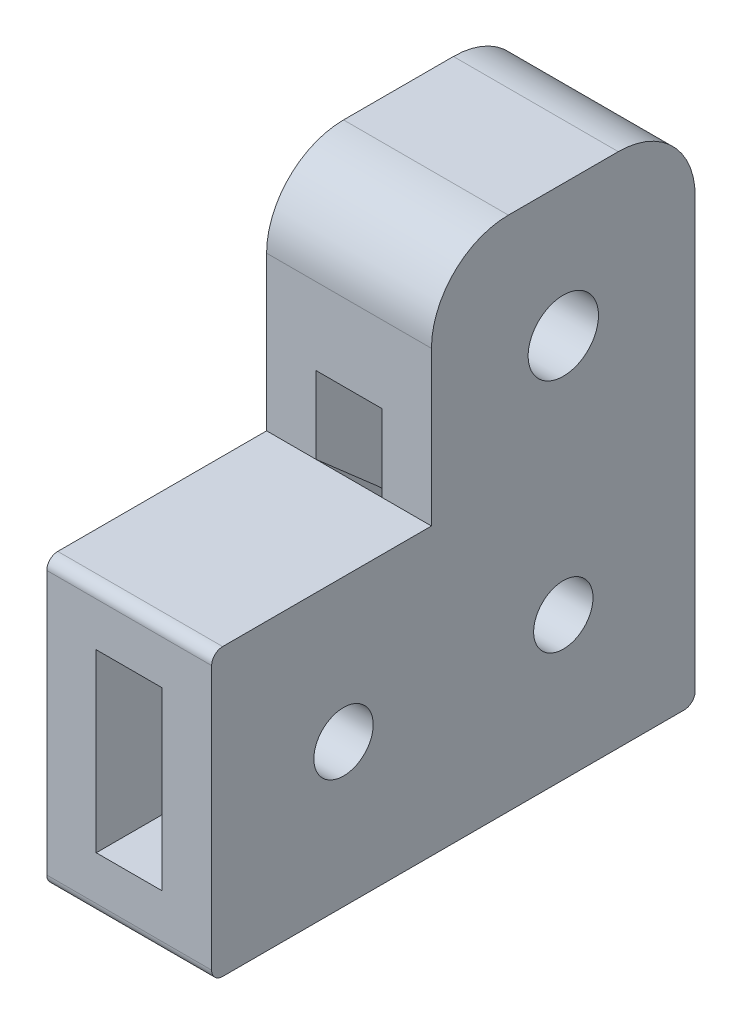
ISO-10303-21;
HEADER;
FILE_DESCRIPTION(('STEP AP214'),'2;1');
FILE_NAME('part.step','',(''),(''),'','','');
FILE_SCHEMA(('AUTOMOTIVE_DESIGN { 1 0 10303 214 1 1 1 1 }'));
ENDSEC;
DATA;
#1=APPLICATION_CONTEXT('core data for automotive mechanical design processes');
#2=APPLICATION_PROTOCOL_DEFINITION('international standard','automotive_design',2000,#1);
#3=PRODUCT_CONTEXT('',#1,'mechanical');
#4=PRODUCT('Part','Part','',(#3));
#5=PRODUCT_RELATED_PRODUCT_CATEGORY('part','',(#4));
#6=PRODUCT_DEFINITION_FORMATION('','',#4);
#7=PRODUCT_DEFINITION_CONTEXT('part definition',#1,'design');
#8=PRODUCT_DEFINITION('design','',#6,#7);
#9=PRODUCT_DEFINITION_SHAPE('','',#8);
#10=(LENGTH_UNIT() NAMED_UNIT(*) SI_UNIT(.MILLI.,.METRE.));
#11=(NAMED_UNIT(*) PLANE_ANGLE_UNIT() SI_UNIT($,.RADIAN.));
#12=(NAMED_UNIT(*) SI_UNIT($,.STERADIAN.) SOLID_ANGLE_UNIT());
#13=UNCERTAINTY_MEASURE_WITH_UNIT(LENGTH_MEASURE(1.E-05),#10,'distance_accuracy_value','');
#14=(GEOMETRIC_REPRESENTATION_CONTEXT(3) GLOBAL_UNCERTAINTY_ASSIGNED_CONTEXT((#13)) GLOBAL_UNIT_ASSIGNED_CONTEXT((#10,
#11,#12)) REPRESENTATION_CONTEXT('',''));
#15=CARTESIAN_POINT('',(0.,0.,0.));
#16=DIRECTION('',(0.,0.,1.));
#17=DIRECTION('',(1.,0.,0.));
#18=AXIS2_PLACEMENT_3D('',#15,#16,#17);
#19=CARTESIAN_POINT('',(7.5,-8.00000000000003,-12.));
#20=DIRECTION('',(-1.,0.,0.));
#21=DIRECTION('',(0.,0.,1.));
#22=AXIS2_PLACEMENT_3D('',#19,#20,#21);
#23=CYLINDRICAL_SURFACE('',#22,2.7);
#24=CARTESIAN_POINT('',(3.,-8.00000000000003,-12.));
#25=DIRECTION('',(-1.,0.,0.));
#26=DIRECTION('',(0.,-1.,0.));
#27=AXIS2_PLACEMENT_3D('',#24,#25,#26);
#28=CIRCLE('',#27,2.7);
#29=CARTESIAN_POINT('',(3.,-10.7,-12.));
#30=VERTEX_POINT('',#29);
#31=EDGE_CURVE('E320',#30,#30,#28,.T.);
#32=ORIENTED_EDGE('',*,*,#31,.T.);
#33=EDGE_LOOP('',(#32));
#34=FACE_BOUND('',#33,.T.);
#35=CARTESIAN_POINT('',(7.5,-8.00000000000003,-12.));
#36=DIRECTION('',(1.,0.,0.));
#37=DIRECTION('',(0.,0.,-1.));
#38=AXIS2_PLACEMENT_3D('',#35,#36,#37);
#39=CIRCLE('',#38,2.7);
#40=CARTESIAN_POINT('',(7.5,-8.00000000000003,-14.7));
#41=VERTEX_POINT('',#40);
#42=EDGE_CURVE('E377',#41,#41,#39,.T.);
#43=ORIENTED_EDGE('',*,*,#42,.T.);
#44=EDGE_LOOP('',(#43));
#45=FACE_BOUND('',#44,.T.);
#46=ADVANCED_FACE('F49',(#34,#45),#23,.F.);
#47=CARTESIAN_POINT('',(7.5,-8.00000000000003,8.));
#48=DIRECTION('',(-1.,0.,0.));
#49=DIRECTION('',(0.,0.,1.));
#50=AXIS2_PLACEMENT_3D('',#47,#48,#49);
#51=CYLINDRICAL_SURFACE('',#50,2.7);
#52=CARTESIAN_POINT('',(3.,-8.00000000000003,8.));
#53=DIRECTION('',(1.,0.,0.));
#54=DIRECTION('',(0.,1.,0.));
#55=AXIS2_PLACEMENT_3D('',#52,#53,#54);
#56=CIRCLE('',#55,2.7);
#57=CARTESIAN_POINT('',(3.,-5.30000000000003,8.));
#58=VERTEX_POINT('',#57);
#59=EDGE_CURVE('E224',#58,#58,#56,.T.);
#60=ORIENTED_EDGE('',*,*,#59,.F.);
#61=EDGE_LOOP('',(#60));
#62=FACE_BOUND('',#61,.T.);
#63=CARTESIAN_POINT('',(7.5,-8.00000000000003,8.));
#64=DIRECTION('',(1.,0.,0.));
#65=DIRECTION('',(0.,0.,-1.));
#66=AXIS2_PLACEMENT_3D('',#63,#64,#65);
#67=CIRCLE('',#66,2.7);
#68=CARTESIAN_POINT('',(7.5,-8.00000000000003,5.3));
#69=VERTEX_POINT('',#68);
#70=EDGE_CURVE('E369',#69,#69,#67,.T.);
#71=ORIENTED_EDGE('',*,*,#70,.T.);
#72=EDGE_LOOP('',(#71));
#73=FACE_BOUND('',#72,.T.);
#74=ADVANCED_FACE('F492',(#62,#73),#51,.F.);
#75=CARTESIAN_POINT('',(7.5,-21.,-24.));
#76=DIRECTION('',(0.,0.,1.));
#77=DIRECTION('',(1.,0.,0.));
#78=AXIS2_PLACEMENT_3D('',#75,#76,#77);
#79=PLANE('',#78);
#80=DIRECTION('',(0.,1.,0.));
#81=VECTOR('',#80,1.);
#82=CARTESIAN_POINT('',(7.5,-21.,-24.));
#83=LINE('',#82,#81);
#84=CARTESIAN_POINT('',(7.5,-20.,-24.));
#85=VERTEX_POINT('',#84);
#86=CARTESIAN_POINT('',(7.5,19.,-24.));
#87=VERTEX_POINT('',#86);
#88=EDGE_CURVE('E339',#85,#87,#83,.T.);
#89=ORIENTED_EDGE('',*,*,#88,.F.);
#90=DIRECTION('',(-1.,0.,0.));
#91=VECTOR('',#90,1.);
#92=CARTESIAN_POINT('',(7.5,-20.,-24.));
#93=LINE('',#92,#91);
#94=CARTESIAN_POINT('',(-7.5,-20.,-24.));
#95=VERTEX_POINT('',#94);
#96=EDGE_CURVE('E258',#85,#95,#93,.T.);
#97=ORIENTED_EDGE('',*,*,#96,.T.);
#98=DIRECTION('',(0.,1.,0.));
#99=VECTOR('',#98,1.);
#100=CARTESIAN_POINT('',(-7.5,-21.,-24.));
#101=LINE('',#100,#99);
#102=CARTESIAN_POINT('',(-7.5,19.,-24.));
#103=VERTEX_POINT('',#102);
#104=EDGE_CURVE('E359',#95,#103,#101,.T.);
#105=ORIENTED_EDGE('',*,*,#104,.T.);
#106=DIRECTION('',(-1.,0.,0.));
#107=VECTOR('',#106,1.);
#108=CARTESIAN_POINT('',(7.5,19.,-24.));
#109=LINE('',#108,#107);
#110=EDGE_CURVE('E294',#103,#87,#109,.F.);
#111=ORIENTED_EDGE('',*,*,#110,.T.);
#112=EDGE_LOOP('',(#89,#97,#105,#111));
#113=FACE_BOUND('',#112,.T.);
#114=DIRECTION('',(-1.,0.,0.));
#115=VECTOR('',#114,1.);
#116=CARTESIAN_POINT('',(-3.,-16.,-24.));
#117=LINE('',#116,#115);
#118=CARTESIAN_POINT('',(3.,-16.,-24.));
#119=VERTEX_POINT('',#118);
#120=CARTESIAN_POINT('',(-3.,-16.,-24.));
#121=VERTEX_POINT('',#120);
#122=EDGE_CURVE('E237',#119,#121,#117,.T.);
#123=ORIENTED_EDGE('',*,*,#122,.F.);
#124=DIRECTION('',(0.,-1.,0.));
#125=VECTOR('',#124,1.);
#126=CARTESIAN_POINT('',(3.,-16.,-24.));
#127=LINE('',#126,#125);
#128=CARTESIAN_POINT('',(3.,0.,-24.));
#129=VERTEX_POINT('',#128);
#130=EDGE_CURVE('E187',#129,#119,#127,.T.);
#131=ORIENTED_EDGE('',*,*,#130,.F.);
#132=DIRECTION('',(1.,0.,0.));
#133=VECTOR('',#132,1.);
#134=CARTESIAN_POINT('',(-3.,0.,-24.));
#135=LINE('',#134,#133);
#136=CARTESIAN_POINT('',(-3.,0.,-24.));
#137=VERTEX_POINT('',#136);
#138=EDGE_CURVE('E420',#137,#129,#135,.T.);
#139=ORIENTED_EDGE('',*,*,#138,.F.);
#140=DIRECTION('',(0.,1.,0.));
#141=VECTOR('',#140,1.);
#142=CARTESIAN_POINT('',(-3.,-16.,-24.));
#143=LINE('',#142,#141);
#144=EDGE_CURVE('E254',#121,#137,#143,.T.);
#145=ORIENTED_EDGE('',*,*,#144,.F.);
#146=EDGE_LOOP('',(#123,#131,#139,#145));
#147=FACE_BOUND('',#146,.T.);
#148=ADVANCED_FACE('F466',(#113,#147),#79,.F.);
#149=CARTESIAN_POINT('',(7.5,26.,0.));
#150=DIRECTION('',(0.,0.,-1.));
#151=DIRECTION('',(0.,1.,0.));
#152=AXIS2_PLACEMENT_3D('',#149,#150,#151);
#153=PLANE('',#152);
#154=DIRECTION('',(0.,-1.,0.));
#155=VECTOR('',#154,1.);
#156=CARTESIAN_POINT('',(7.5,26.,0.));
#157=LINE('',#156,#155);
#158=CARTESIAN_POINT('',(7.5,19.,0.));
#159=VERTEX_POINT('',#158);
#160=CARTESIAN_POINT('',(7.5,4.99999999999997,0.));
#161=VERTEX_POINT('',#160);
#162=EDGE_CURVE('E335',#159,#161,#157,.T.);
#163=ORIENTED_EDGE('',*,*,#162,.F.);
#164=DIRECTION('',(-1.,0.,0.));
#165=VECTOR('',#164,1.);
#166=CARTESIAN_POINT('',(7.5,19.,0.));
#167=LINE('',#166,#165);
#168=CARTESIAN_POINT('',(-7.5,19.,0.));
#169=VERTEX_POINT('',#168);
#170=EDGE_CURVE('E239',#159,#169,#167,.T.);
#171=ORIENTED_EDGE('',*,*,#170,.T.);
#172=DIRECTION('',(0.,-1.,0.));
#173=VECTOR('',#172,1.);
#174=CARTESIAN_POINT('',(-7.5,26.,0.));
#175=LINE('',#174,#173);
#176=CARTESIAN_POINT('',(-7.5,4.99999999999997,0.));
#177=VERTEX_POINT('',#176);
#178=EDGE_CURVE('E351',#169,#177,#175,.T.);
#179=ORIENTED_EDGE('',*,*,#178,.T.);
#180=DIRECTION('',(-1.,0.,0.));
#181=VECTOR('',#180,1.);
#182=CARTESIAN_POINT('',(7.5,4.99999999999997,0.));
#183=LINE('',#182,#181);
#184=CARTESIAN_POINT('',(-3.,4.99999999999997,0.));
#185=VERTEX_POINT('',#184);
#186=EDGE_CURVE('E321',#185,#177,#183,.T.);
#187=ORIENTED_EDGE('',*,*,#186,.F.);
#188=DIRECTION('',(0.,-1.,0.));
#189=VECTOR('',#188,1.);
#190=CARTESIAN_POINT('',(-3.,12.,0.));
#191=LINE('',#190,#189);
#192=CARTESIAN_POINT('',(-3.,12.,0.));
#193=VERTEX_POINT('',#192);
#194=EDGE_CURVE('E400',#193,#185,#191,.T.);
#195=ORIENTED_EDGE('',*,*,#194,.F.);
#196=DIRECTION('',(-1.,0.,0.));
#197=VECTOR('',#196,1.);
#198=CARTESIAN_POINT('',(-3.,12.,0.));
#199=LINE('',#198,#197);
#200=CARTESIAN_POINT('',(3.,12.,0.));
#201=VERTEX_POINT('',#200);
#202=EDGE_CURVE('E394',#201,#193,#199,.T.);
#203=ORIENTED_EDGE('',*,*,#202,.F.);
#204=DIRECTION('',(0.,1.,0.));
#205=VECTOR('',#204,1.);
#206=CARTESIAN_POINT('',(3.,12.,0.));
#207=LINE('',#206,#205);
#208=CARTESIAN_POINT('',(3.,4.99999999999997,0.));
#209=VERTEX_POINT('',#208);
#210=EDGE_CURVE('E403',#209,#201,#207,.T.);
#211=ORIENTED_EDGE('',*,*,#210,.F.);
#212=EDGE_CURVE('E323',#161,#209,#183,.T.);
#213=ORIENTED_EDGE('',*,*,#212,.F.);
#214=EDGE_LOOP('',(#163,#171,#179,#187,#195,#203,#211,#213));
#215=FACE_BOUND('',#214,.T.);
#216=ADVANCED_FACE('F463',(#215),#153,.F.);
#217=CARTESIAN_POINT('',(-3.,-8.00000000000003,-12.));
#218=DIRECTION('',(1.,0.,0.));
#219=DIRECTION('',(0.,0.,-1.));
#220=AXIS2_PLACEMENT_3D('',#217,#218,#219);
#221=CIRCLE('',#220,2.7);
#222=CARTESIAN_POINT('',(-3.,-8.00000000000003,-14.7));
#223=VERTEX_POINT('',#222);
#224=EDGE_CURVE('E312',#223,#223,#221,.T.);
#225=ORIENTED_EDGE('',*,*,#224,.T.);
#226=EDGE_LOOP('',(#225));
#227=FACE_BOUND('',#226,.T.);
#228=CARTESIAN_POINT('',(-7.5,-8.00000000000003,-12.));
#229=DIRECTION('',(1.,0.,0.));
#230=DIRECTION('',(0.,0.,-1.));
#231=AXIS2_PLACEMENT_3D('',#228,#229,#230);
#232=CIRCLE('',#231,2.7);
#233=CARTESIAN_POINT('',(-7.5,-8.00000000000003,-14.7));
#234=VERTEX_POINT('',#233);
#235=EDGE_CURVE('E385',#234,#234,#232,.T.);
#236=ORIENTED_EDGE('',*,*,#235,.F.);
#237=EDGE_LOOP('',(#236));
#238=FACE_BOUND('',#237,.T.);
#239=ADVANCED_FACE('F470',(#227,#238),#23,.F.);
#240=CARTESIAN_POINT('',(7.5,0.,0.));
#241=DIRECTION('',(1.,0.,0.));
#242=DIRECTION('',(0.,0.,-1.));
#243=AXIS2_PLACEMENT_3D('',#240,#241,#242);
#244=PLANE('',#243);
#245=ORIENTED_EDGE('',*,*,#42,.F.);
#246=EDGE_LOOP('',(#245));
#247=FACE_BOUND('',#246,.T.);
#248=DIRECTION('',(0.,0.,-1.));
#249=VECTOR('',#248,1.);
#250=CARTESIAN_POINT('',(7.5,-21.,20.));
#251=LINE('',#250,#249);
#252=CARTESIAN_POINT('',(7.5,-21.,19.));
#253=VERTEX_POINT('',#252);
#254=CARTESIAN_POINT('',(7.5,-21.,-23.));
#255=VERTEX_POINT('',#254);
#256=EDGE_CURVE('E344',#253,#255,#251,.T.);
#257=ORIENTED_EDGE('',*,*,#256,.T.);
#258=CARTESIAN_POINT('',(7.5,-20.,-23.));
#259=DIRECTION('',(1.,0.,0.));
#260=DIRECTION('',(0.,0.,-1.));
#261=AXIS2_PLACEMENT_3D('',#258,#259,#260);
#262=CIRCLE('',#261,1.);
#263=EDGE_CURVE('E283',#255,#85,#262,.T.);
#264=ORIENTED_EDGE('',*,*,#263,.T.);
#265=ORIENTED_EDGE('',*,*,#88,.T.);
#266=CARTESIAN_POINT('',(7.5,19.,-17.));
#267=DIRECTION('',(1.,0.,0.));
#268=DIRECTION('',(0.,0.,-1.));
#269=AXIS2_PLACEMENT_3D('',#266,#267,#268);
#270=CIRCLE('',#269,7.);
#271=CARTESIAN_POINT('',(7.5,26.,-17.));
#272=VERTEX_POINT('',#271);
#273=EDGE_CURVE('E293',#87,#272,#270,.T.);
#274=ORIENTED_EDGE('',*,*,#273,.T.);
#275=DIRECTION('',(0.,0.,1.));
#276=VECTOR('',#275,1.);
#277=CARTESIAN_POINT('',(7.5,26.,-24.));
#278=LINE('',#277,#276);
#279=CARTESIAN_POINT('',(7.5,26.,-7.));
#280=VERTEX_POINT('',#279);
#281=EDGE_CURVE('E331',#272,#280,#278,.T.);
#282=ORIENTED_EDGE('',*,*,#281,.T.);
#283=CARTESIAN_POINT('',(7.5,19.,-7.));
#284=DIRECTION('',(1.,0.,0.));
#285=DIRECTION('',(0.,0.,-1.));
#286=AXIS2_PLACEMENT_3D('',#283,#284,#285);
#287=CIRCLE('',#286,7.);
#288=EDGE_CURVE('E291',#280,#159,#287,.T.);
#289=ORIENTED_EDGE('',*,*,#288,.T.);
#290=ORIENTED_EDGE('',*,*,#162,.T.);
#291=DIRECTION('',(0.,0.,1.));
#292=VECTOR('',#291,1.);
#293=CARTESIAN_POINT('',(7.5,4.99999999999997,0.));
#294=LINE('',#293,#292);
#295=CARTESIAN_POINT('',(7.5,4.99999999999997,19.));
#296=VERTEX_POINT('',#295);
#297=EDGE_CURVE('E329',#161,#296,#294,.T.);
#298=ORIENTED_EDGE('',*,*,#297,.T.);
#299=CARTESIAN_POINT('',(7.5,3.99999999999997,19.));
#300=DIRECTION('',(1.,0.,0.));
#301=DIRECTION('',(0.,0.,-1.));
#302=AXIS2_PLACEMENT_3D('',#299,#300,#301);
#303=CIRCLE('',#302,1.);
#304=CARTESIAN_POINT('',(7.5,3.99999999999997,20.));
#305=VERTEX_POINT('',#304);
#306=EDGE_CURVE('E75',#296,#305,#303,.T.);
#307=ORIENTED_EDGE('',*,*,#306,.T.);
#308=DIRECTION('',(0.,-1.,0.));
#309=VECTOR('',#308,1.);
#310=CARTESIAN_POINT('',(7.5,4.99999999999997,20.));
#311=LINE('',#310,#309);
#312=CARTESIAN_POINT('',(7.5,-20.,20.));
#313=VERTEX_POINT('',#312);
#314=EDGE_CURVE('E348',#305,#313,#311,.T.);
#315=ORIENTED_EDGE('',*,*,#314,.T.);
#316=CARTESIAN_POINT('',(7.5,-20.,19.));
#317=DIRECTION('',(1.,0.,0.));
#318=DIRECTION('',(0.,0.,-1.));
#319=AXIS2_PLACEMENT_3D('',#316,#317,#318);
#320=CIRCLE('',#319,1.);
#321=EDGE_CURVE('E277',#313,#253,#320,.T.);
#322=ORIENTED_EDGE('',*,*,#321,.T.);
#323=EDGE_LOOP('',(#257,#264,#265,#274,#282,#289,#290,#298,#307,#315,#322));
#324=FACE_BOUND('',#323,.T.);
#325=ORIENTED_EDGE('',*,*,#70,.F.);
#326=EDGE_LOOP('',(#325));
#327=FACE_BOUND('',#326,.T.);
#328=CARTESIAN_POINT('',(7.5,14.,-12.));
#329=DIRECTION('',(1.,0.,0.));
#330=DIRECTION('',(0.,0.,-1.));
#331=AXIS2_PLACEMENT_3D('',#328,#329,#330);
#332=CIRCLE('',#331,3.2);
#333=CARTESIAN_POINT('',(7.5,14.,-15.2));
#334=VERTEX_POINT('',#333);
#335=EDGE_CURVE('E388',#334,#334,#332,.T.);
#336=ORIENTED_EDGE('',*,*,#335,.F.);
#337=EDGE_LOOP('',(#336));
#338=FACE_BOUND('',#337,.T.);
#339=ADVANCED_FACE('F533',(#247,#324,#327,#338),#244,.T.);
#340=CARTESIAN_POINT('',(-7.5,0.,0.));
#341=DIRECTION('',(1.,0.,0.));
#342=DIRECTION('',(0.,0.,-1.));
#343=AXIS2_PLACEMENT_3D('',#340,#341,#342);
#344=PLANE('',#343);
#345=ORIENTED_EDGE('',*,*,#104,.F.);
#346=CARTESIAN_POINT('',(-7.5,-20.,-23.));
#347=DIRECTION('',(1.,0.,0.));
#348=DIRECTION('',(0.,0.,-1.));
#349=AXIS2_PLACEMENT_3D('',#346,#347,#348);
#350=CIRCLE('',#349,1.);
#351=CARTESIAN_POINT('',(-7.5,-21.,-23.));
#352=VERTEX_POINT('',#351);
#353=EDGE_CURVE('E267',#95,#352,#350,.F.);
#354=ORIENTED_EDGE('',*,*,#353,.T.);
#355=DIRECTION('',(0.,0.,-1.));
#356=VECTOR('',#355,1.);
#357=CARTESIAN_POINT('',(-7.5,-21.,20.));
#358=LINE('',#357,#356);
#359=CARTESIAN_POINT('',(-7.5,-21.,19.));
#360=VERTEX_POINT('',#359);
#361=EDGE_CURVE('E361',#360,#352,#358,.T.);
#362=ORIENTED_EDGE('',*,*,#361,.F.);
#363=CARTESIAN_POINT('',(-7.5,-20.,19.));
#364=DIRECTION('',(1.,0.,0.));
#365=DIRECTION('',(0.,0.,-1.));
#366=AXIS2_PLACEMENT_3D('',#363,#364,#365);
#367=CIRCLE('',#366,1.);
#368=CARTESIAN_POINT('',(-7.5,-20.,20.));
#369=VERTEX_POINT('',#368);
#370=EDGE_CURVE('E261',#360,#369,#367,.F.);
#371=ORIENTED_EDGE('',*,*,#370,.T.);
#372=DIRECTION('',(0.,-1.,0.));
#373=VECTOR('',#372,1.);
#374=CARTESIAN_POINT('',(-7.5,4.99999999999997,20.));
#375=LINE('',#374,#373);
#376=CARTESIAN_POINT('',(-7.5,3.99999999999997,20.));
#377=VERTEX_POINT('',#376);
#378=EDGE_CURVE('E370',#377,#369,#375,.T.);
#379=ORIENTED_EDGE('',*,*,#378,.F.);
#380=CARTESIAN_POINT('',(-7.5,3.99999999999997,19.));
#381=DIRECTION('',(1.,0.,0.));
#382=DIRECTION('',(0.,0.,-1.));
#383=AXIS2_PLACEMENT_3D('',#380,#381,#382);
#384=CIRCLE('',#383,1.);
#385=CARTESIAN_POINT('',(-7.5,4.99999999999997,19.));
#386=VERTEX_POINT('',#385);
#387=EDGE_CURVE('E256',#377,#386,#384,.F.);
#388=ORIENTED_EDGE('',*,*,#387,.T.);
#389=DIRECTION('',(0.,0.,1.));
#390=VECTOR('',#389,1.);
#391=CARTESIAN_POINT('',(-7.5,4.99999999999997,0.));
#392=LINE('',#391,#390);
#393=EDGE_CURVE('E349',#177,#386,#392,.T.);
#394=ORIENTED_EDGE('',*,*,#393,.F.);
#395=ORIENTED_EDGE('',*,*,#178,.F.);
#396=CARTESIAN_POINT('',(-7.5,19.,-7.));
#397=DIRECTION('',(1.,0.,0.));
#398=DIRECTION('',(0.,0.,-1.));
#399=AXIS2_PLACEMENT_3D('',#396,#397,#398);
#400=CIRCLE('',#399,7.);
#401=CARTESIAN_POINT('',(-7.5,26.,-7.));
#402=VERTEX_POINT('',#401);
#403=EDGE_CURVE('E303',#169,#402,#400,.F.);
#404=ORIENTED_EDGE('',*,*,#403,.T.);
#405=DIRECTION('',(0.,0.,1.));
#406=VECTOR('',#405,1.);
#407=CARTESIAN_POINT('',(-7.5,26.,-24.));
#408=LINE('',#407,#406);
#409=CARTESIAN_POINT('',(-7.5,26.,-17.));
#410=VERTEX_POINT('',#409);
#411=EDGE_CURVE('E358',#410,#402,#408,.T.);
#412=ORIENTED_EDGE('',*,*,#411,.F.);
#413=CARTESIAN_POINT('',(-7.5,19.,-17.));
#414=DIRECTION('',(1.,0.,0.));
#415=DIRECTION('',(0.,0.,-1.));
#416=AXIS2_PLACEMENT_3D('',#413,#414,#415);
#417=CIRCLE('',#416,7.);
#418=EDGE_CURVE('E299',#410,#103,#417,.F.);
#419=ORIENTED_EDGE('',*,*,#418,.T.);
#420=EDGE_LOOP('',(#345,#354,#362,#371,#379,#388,#394,#395,#404,#412,#419));
#421=FACE_BOUND('',#420,.T.);
#422=CARTESIAN_POINT('',(-7.5,-8.00000000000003,8.));
#423=DIRECTION('',(1.,0.,0.));
#424=DIRECTION('',(0.,0.,-1.));
#425=AXIS2_PLACEMENT_3D('',#422,#423,#424);
#426=CIRCLE('',#425,2.7);
#427=CARTESIAN_POINT('',(-7.5,-8.00000000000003,5.3));
#428=VERTEX_POINT('',#427);
#429=EDGE_CURVE('E372',#428,#428,#426,.T.);
#430=ORIENTED_EDGE('',*,*,#429,.T.);
#431=EDGE_LOOP('',(#430));
#432=FACE_BOUND('',#431,.T.);
#433=ORIENTED_EDGE('',*,*,#235,.T.);
#434=EDGE_LOOP('',(#433));
#435=FACE_BOUND('',#434,.T.);
#436=CARTESIAN_POINT('',(-7.5,14.,-12.));
#437=DIRECTION('',(1.,0.,0.));
#438=DIRECTION('',(0.,0.,-1.));
#439=AXIS2_PLACEMENT_3D('',#436,#437,#438);
#440=CIRCLE('',#439,3.2);
#441=CARTESIAN_POINT('',(-7.5,14.,-15.2));
#442=VERTEX_POINT('',#441);
#443=EDGE_CURVE('E386',#442,#442,#440,.T.);
#444=ORIENTED_EDGE('',*,*,#443,.T.);
#445=EDGE_LOOP('',(#444));
#446=FACE_BOUND('',#445,.T.);
#447=ADVANCED_FACE('F462',(#421,#432,#435,#446),#344,.F.);
#448=CARTESIAN_POINT('',(7.5,4.99999999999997,20.));
#449=DIRECTION('',(0.,0.,-1.));
#450=DIRECTION('',(0.,1.,0.));
#451=AXIS2_PLACEMENT_3D('',#448,#449,#450);
#452=PLANE('',#451);
#453=DIRECTION('',(1.,0.,0.));
#454=VECTOR('',#453,1.);
#455=CARTESIAN_POINT('',(-3.,0.,20.));
#456=LINE('',#455,#454);
#457=CARTESIAN_POINT('',(-3.,0.,20.));
#458=VERTEX_POINT('',#457);
#459=CARTESIAN_POINT('',(3.,0.,20.));
#460=VERTEX_POINT('',#459);
#461=EDGE_CURVE('E194',#458,#460,#456,.T.);
#462=ORIENTED_EDGE('',*,*,#461,.T.);
#463=DIRECTION('',(0.,-1.,0.));
#464=VECTOR('',#463,1.);
#465=CARTESIAN_POINT('',(3.,-16.,20.));
#466=LINE('',#465,#464);
#467=CARTESIAN_POINT('',(3.,-16.,20.));
#468=VERTEX_POINT('',#467);
#469=EDGE_CURVE('E185',#460,#468,#466,.T.);
#470=ORIENTED_EDGE('',*,*,#469,.T.);
#471=DIRECTION('',(-1.,0.,0.));
#472=VECTOR('',#471,1.);
#473=CARTESIAN_POINT('',(-3.,-16.,20.));
#474=LINE('',#473,#472);
#475=CARTESIAN_POINT('',(-3.,-16.,20.));
#476=VERTEX_POINT('',#475);
#477=EDGE_CURVE('E198',#468,#476,#474,.T.);
#478=ORIENTED_EDGE('',*,*,#477,.T.);
#479=DIRECTION('',(0.,1.,0.));
#480=VECTOR('',#479,1.);
#481=CARTESIAN_POINT('',(-3.,-16.,20.));
#482=LINE('',#481,#480);
#483=EDGE_CURVE('E202',#476,#458,#482,.T.);
#484=ORIENTED_EDGE('',*,*,#483,.T.);
#485=EDGE_LOOP('',(#462,#470,#478,#484));
#486=FACE_BOUND('',#485,.T.);
#487=ORIENTED_EDGE('',*,*,#378,.T.);
#488=DIRECTION('',(-1.,0.,0.));
#489=VECTOR('',#488,1.);
#490=CARTESIAN_POINT('',(7.5,-20.,20.));
#491=LINE('',#490,#489);
#492=EDGE_CURVE('E56',#369,#313,#491,.F.);
#493=ORIENTED_EDGE('',*,*,#492,.T.);
#494=ORIENTED_EDGE('',*,*,#314,.F.);
#495=DIRECTION('',(-1.,0.,0.));
#496=VECTOR('',#495,1.);
#497=CARTESIAN_POINT('',(7.5,3.99999999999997,20.));
#498=LINE('',#497,#496);
#499=EDGE_CURVE('E284',#305,#377,#498,.T.);
#500=ORIENTED_EDGE('',*,*,#499,.T.);
#501=EDGE_LOOP('',(#487,#493,#494,#500));
#502=FACE_BOUND('',#501,.T.);
#503=ADVANCED_FACE('F203',(#486,#502),#452,.F.);
#504=CARTESIAN_POINT('',(7.5,-21.,20.));
#505=DIRECTION('',(0.,1.,0.));
#506=DIRECTION('',(0.,0.,1.));
#507=AXIS2_PLACEMENT_3D('',#504,#505,#506);
#508=PLANE('',#507);
#509=ORIENTED_EDGE('',*,*,#361,.T.);
#510=DIRECTION('',(-1.,0.,0.));
#511=VECTOR('',#510,1.);
#512=CARTESIAN_POINT('',(7.5,-21.,-23.));
#513=LINE('',#512,#511);
#514=EDGE_CURVE('E271',#352,#255,#513,.F.);
#515=ORIENTED_EDGE('',*,*,#514,.T.);
#516=ORIENTED_EDGE('',*,*,#256,.F.);
#517=DIRECTION('',(-1.,0.,0.));
#518=VECTOR('',#517,1.);
#519=CARTESIAN_POINT('',(7.5,-21.,19.));
#520=LINE('',#519,#518);
#521=EDGE_CURVE('E269',#253,#360,#520,.T.);
#522=ORIENTED_EDGE('',*,*,#521,.T.);
#523=EDGE_LOOP('',(#509,#515,#516,#522));
#524=FACE_BOUND('',#523,.T.);
#525=ADVANCED_FACE('F500',(#524),#508,.F.);
#526=CARTESIAN_POINT('',(7.5,26.,-24.));
#527=DIRECTION('',(0.,-1.,0.));
#528=DIRECTION('',(0.,0.,-1.));
#529=AXIS2_PLACEMENT_3D('',#526,#527,#528);
#530=PLANE('',#529);
#531=ORIENTED_EDGE('',*,*,#281,.F.);
#532=DIRECTION('',(-1.,0.,0.));
#533=VECTOR('',#532,1.);
#534=CARTESIAN_POINT('',(7.5,26.,-17.));
#535=LINE('',#534,#533);
#536=EDGE_CURVE('E306',#272,#410,#535,.T.);
#537=ORIENTED_EDGE('',*,*,#536,.T.);
#538=ORIENTED_EDGE('',*,*,#411,.T.);
#539=DIRECTION('',(-1.,0.,0.));
#540=VECTOR('',#539,1.);
#541=CARTESIAN_POINT('',(7.5,26.,-7.));
#542=LINE('',#541,#540);
#543=EDGE_CURVE('E309',#402,#280,#542,.F.);
#544=ORIENTED_EDGE('',*,*,#543,.T.);
#545=EDGE_LOOP('',(#531,#537,#538,#544));
#546=FACE_BOUND('',#545,.T.);
#547=ADVANCED_FACE('F459',(#546),#530,.F.);
#548=CARTESIAN_POINT('',(7.5,4.99999999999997,0.));
#549=DIRECTION('',(0.,-1.,0.));
#550=DIRECTION('',(0.,0.,-1.));
#551=AXIS2_PLACEMENT_3D('',#548,#549,#550);
#552=PLANE('',#551);
#553=ORIENTED_EDGE('',*,*,#393,.T.);
#554=DIRECTION('',(-1.,0.,0.));
#555=VECTOR('',#554,1.);
#556=CARTESIAN_POINT('',(7.5,4.99999999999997,19.));
#557=LINE('',#556,#555);
#558=EDGE_CURVE('E12',#386,#296,#557,.F.);
#559=ORIENTED_EDGE('',*,*,#558,.T.);
#560=ORIENTED_EDGE('',*,*,#297,.F.);
#561=ORIENTED_EDGE('',*,*,#212,.T.);
#562=DIRECTION('',(1.,0.,0.));
#563=VECTOR('',#562,1.);
#564=CARTESIAN_POINT('',(-3.,4.99999999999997,0.));
#565=LINE('',#564,#563);
#566=EDGE_CURVE('E402',#185,#209,#565,.T.);
#567=ORIENTED_EDGE('',*,*,#566,.F.);
#568=ORIENTED_EDGE('',*,*,#186,.T.);
#569=EDGE_LOOP('',(#553,#559,#560,#561,#567,#568));
#570=FACE_BOUND('',#569,.T.);
#571=ADVANCED_FACE('F449',(#570),#552,.F.);
#572=CARTESIAN_POINT('',(-3.,-8.00000000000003,8.));
#573=DIRECTION('',(-1.,0.,0.));
#574=DIRECTION('',(0.,-1.,0.));
#575=AXIS2_PLACEMENT_3D('',#572,#573,#574);
#576=CIRCLE('',#575,2.7);
#577=CARTESIAN_POINT('',(-3.,-10.7,8.));
#578=VERTEX_POINT('',#577);
#579=EDGE_CURVE('E223',#578,#578,#576,.T.);
#580=ORIENTED_EDGE('',*,*,#579,.F.);
#581=EDGE_LOOP('',(#580));
#582=FACE_BOUND('',#581,.T.);
#583=ORIENTED_EDGE('',*,*,#429,.F.);
#584=EDGE_LOOP('',(#583));
#585=FACE_BOUND('',#584,.T.);
#586=ADVANCED_FACE('F456',(#582,#585),#51,.F.);
#587=CARTESIAN_POINT('',(7.5,14.,-12.));
#588=DIRECTION('',(-1.,0.,0.));
#589=DIRECTION('',(0.,0.,1.));
#590=AXIS2_PLACEMENT_3D('',#587,#588,#589);
#591=CYLINDRICAL_SURFACE('',#590,3.2);
#592=ORIENTED_EDGE('',*,*,#335,.T.);
#593=EDGE_LOOP('',(#592));
#594=FACE_BOUND('',#593,.T.);
#595=ORIENTED_EDGE('',*,*,#443,.F.);
#596=EDGE_LOOP('',(#595));
#597=FACE_BOUND('',#596,.T.);
#598=ADVANCED_FACE('F553',(#594,#597),#591,.F.);
#599=CARTESIAN_POINT('',(0.,2.83185840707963,-2.47787610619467));
#600=DIRECTION('',(0.,0.752576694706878,-0.658504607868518));
#601=DIRECTION('',(0.,0.658504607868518,0.752576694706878));
#602=AXIS2_PLACEMENT_3D('',#599,#600,#601);
#603=PLANE('',#602);
#604=DIRECTION('',(1.,0.,0.));
#605=VECTOR('',#604,1.);
#606=CARTESIAN_POINT('',(0.,0.,-5.71428571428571));
#607=LINE('',#606,#605);
#608=CARTESIAN_POINT('',(-3.,0.,-5.71428571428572));
#609=VERTEX_POINT('',#608);
#610=CARTESIAN_POINT('',(3.,0.,-5.71428571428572));
#611=VERTEX_POINT('',#610);
#612=EDGE_CURVE('E211',#609,#611,#607,.T.);
#613=ORIENTED_EDGE('',*,*,#612,.F.);
#614=DIRECTION('',(0.,0.658504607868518,0.752576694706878));
#615=VECTOR('',#614,1.);
#616=CARTESIAN_POINT('',(-3.,-16.,-24.));
#617=LINE('',#616,#615);
#618=EDGE_CURVE('E238',#609,#185,#617,.T.);
#619=ORIENTED_EDGE('',*,*,#618,.T.);
#620=ORIENTED_EDGE('',*,*,#566,.T.);
#621=DIRECTION('',(0.,0.658504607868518,0.752576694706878));
#622=VECTOR('',#621,1.);
#623=CARTESIAN_POINT('',(3.,-16.,-24.));
#624=LINE('',#623,#622);
#625=EDGE_CURVE('E234',#611,#209,#624,.T.);
#626=ORIENTED_EDGE('',*,*,#625,.F.);
#627=EDGE_LOOP('',(#613,#619,#620,#626));
#628=FACE_BOUND('',#627,.T.);
#629=ADVANCED_FACE('F551',(#628),#603,.T.);
#630=CARTESIAN_POINT('',(-3.,0.,0.));
#631=DIRECTION('',(1.,0.,0.));
#632=DIRECTION('',(0.,0.,-1.));
#633=AXIS2_PLACEMENT_3D('',#630,#631,#632);
#634=PLANE('',#633);
#635=ORIENTED_EDGE('',*,*,#224,.F.);
#636=EDGE_LOOP('',(#635));
#637=FACE_BOUND('',#636,.T.);
#638=ORIENTED_EDGE('',*,*,#144,.T.);
#639=DIRECTION('',(0.,0.447213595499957,0.894427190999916));
#640=VECTOR('',#639,1.);
#641=CARTESIAN_POINT('',(-3.,0.,-24.));
#642=LINE('',#641,#640);
#643=EDGE_CURVE('E410',#137,#193,#642,.T.);
#644=ORIENTED_EDGE('',*,*,#643,.T.);
#645=ORIENTED_EDGE('',*,*,#194,.T.);
#646=ORIENTED_EDGE('',*,*,#618,.F.);
#647=DIRECTION('',(0.,0.,-1.));
#648=VECTOR('',#647,1.);
#649=CARTESIAN_POINT('',(-3.,0.,20.));
#650=LINE('',#649,#648);
#651=EDGE_CURVE('E218',#458,#609,#650,.T.);
#652=ORIENTED_EDGE('',*,*,#651,.F.);
#653=ORIENTED_EDGE('',*,*,#483,.F.);
#654=DIRECTION('',(0.,0.,-1.));
#655=VECTOR('',#654,1.);
#656=CARTESIAN_POINT('',(-3.,-16.,20.));
#657=LINE('',#656,#655);
#658=EDGE_CURVE('E193',#476,#121,#657,.T.);
#659=ORIENTED_EDGE('',*,*,#658,.T.);
#660=EDGE_LOOP('',(#638,#644,#645,#646,#652,#653,#659));
#661=FACE_BOUND('',#660,.T.);
#662=ORIENTED_EDGE('',*,*,#579,.T.);
#663=EDGE_LOOP('',(#662));
#664=FACE_BOUND('',#663,.T.);
#665=ADVANCED_FACE('F559',(#637,#661,#664),#634,.T.);
#666=CARTESIAN_POINT('',(3.,0.,0.));
#667=DIRECTION('',(-1.,0.,0.));
#668=DIRECTION('',(0.,-1.,0.));
#669=AXIS2_PLACEMENT_3D('',#666,#667,#668);
#670=PLANE('',#669);
#671=DIRECTION('',(0.,0.,-1.));
#672=VECTOR('',#671,1.);
#673=CARTESIAN_POINT('',(3.,0.,20.));
#674=LINE('',#673,#672);
#675=EDGE_CURVE('E214',#460,#611,#674,.T.);
#676=ORIENTED_EDGE('',*,*,#675,.T.);
#677=ORIENTED_EDGE('',*,*,#625,.T.);
#678=ORIENTED_EDGE('',*,*,#210,.T.);
#679=DIRECTION('',(0.,0.447213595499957,0.894427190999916));
#680=VECTOR('',#679,1.);
#681=CARTESIAN_POINT('',(3.,0.,-24.));
#682=LINE('',#681,#680);
#683=EDGE_CURVE('E243',#129,#201,#682,.T.);
#684=ORIENTED_EDGE('',*,*,#683,.F.);
#685=ORIENTED_EDGE('',*,*,#130,.T.);
#686=DIRECTION('',(0.,0.,-1.));
#687=VECTOR('',#686,1.);
#688=CARTESIAN_POINT('',(3.,-16.,20.));
#689=LINE('',#688,#687);
#690=EDGE_CURVE('E176',#468,#119,#689,.T.);
#691=ORIENTED_EDGE('',*,*,#690,.F.);
#692=ORIENTED_EDGE('',*,*,#469,.F.);
#693=EDGE_LOOP('',(#676,#677,#678,#684,#685,#691,#692));
#694=FACE_BOUND('',#693,.T.);
#695=ORIENTED_EDGE('',*,*,#31,.F.);
#696=EDGE_LOOP('',(#695));
#697=FACE_BOUND('',#696,.T.);
#698=ORIENTED_EDGE('',*,*,#59,.T.);
#699=EDGE_LOOP('',(#698));
#700=FACE_BOUND('',#699,.T.);
#701=ADVANCED_FACE('F177',(#694,#697,#700),#670,.T.);
#702=CARTESIAN_POINT('',(0.,9.59999999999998,-4.79999999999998));
#703=DIRECTION('',(0.,-0.894427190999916,0.447213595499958));
#704=DIRECTION('',(0.,-0.447213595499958,-0.894427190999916));
#705=AXIS2_PLACEMENT_3D('',#702,#703,#704);
#706=PLANE('',#705);
#707=ORIENTED_EDGE('',*,*,#643,.F.);
#708=ORIENTED_EDGE('',*,*,#138,.T.);
#709=ORIENTED_EDGE('',*,*,#683,.T.);
#710=ORIENTED_EDGE('',*,*,#202,.T.);
#711=EDGE_LOOP('',(#707,#708,#709,#710));
#712=FACE_BOUND('',#711,.T.);
#713=ADVANCED_FACE('F510',(#712),#706,.T.);
#714=CARTESIAN_POINT('',(7.5,19.,-17.));
#715=DIRECTION('',(-1.,0.,0.));
#716=DIRECTION('',(0.,0.,1.));
#717=AXIS2_PLACEMENT_3D('',#714,#715,#716);
#718=CYLINDRICAL_SURFACE('',#717,7.);
#719=ORIENTED_EDGE('',*,*,#273,.F.);
#720=ORIENTED_EDGE('',*,*,#110,.F.);
#721=ORIENTED_EDGE('',*,*,#418,.F.);
#722=ORIENTED_EDGE('',*,*,#536,.F.);
#723=EDGE_LOOP('',(#719,#720,#721,#722));
#724=FACE_BOUND('',#723,.T.);
#725=ADVANCED_FACE('F503',(#724),#718,.T.);
#726=CARTESIAN_POINT('',(7.5,19.,-7.));
#727=DIRECTION('',(-1.,0.,0.));
#728=DIRECTION('',(0.,0.,1.));
#729=AXIS2_PLACEMENT_3D('',#726,#727,#728);
#730=CYLINDRICAL_SURFACE('',#729,7.);
#731=ORIENTED_EDGE('',*,*,#288,.F.);
#732=ORIENTED_EDGE('',*,*,#543,.F.);
#733=ORIENTED_EDGE('',*,*,#403,.F.);
#734=ORIENTED_EDGE('',*,*,#170,.F.);
#735=EDGE_LOOP('',(#731,#732,#733,#734));
#736=FACE_BOUND('',#735,.T.);
#737=ADVANCED_FACE('F506',(#736),#730,.T.);
#738=CARTESIAN_POINT('',(-3.,0.,20.));
#739=DIRECTION('',(0.,1.,0.));
#740=DIRECTION('',(0.,0.,1.));
#741=AXIS2_PLACEMENT_3D('',#738,#739,#740);
#742=PLANE('',#741);
#743=ORIENTED_EDGE('',*,*,#612,.T.);
#744=ORIENTED_EDGE('',*,*,#675,.F.);
#745=ORIENTED_EDGE('',*,*,#461,.F.);
#746=ORIENTED_EDGE('',*,*,#651,.T.);
#747=EDGE_LOOP('',(#743,#744,#745,#746));
#748=FACE_BOUND('',#747,.T.);
#749=ADVANCED_FACE('F512',(#748),#742,.F.);
#750=CARTESIAN_POINT('',(-3.,-16.,20.));
#751=DIRECTION('',(0.,-1.,0.));
#752=DIRECTION('',(0.,0.,-1.));
#753=AXIS2_PLACEMENT_3D('',#750,#751,#752);
#754=PLANE('',#753);
#755=ORIENTED_EDGE('',*,*,#122,.T.);
#756=ORIENTED_EDGE('',*,*,#658,.F.);
#757=ORIENTED_EDGE('',*,*,#477,.F.);
#758=ORIENTED_EDGE('',*,*,#690,.T.);
#759=EDGE_LOOP('',(#755,#756,#757,#758));
#760=FACE_BOUND('',#759,.T.);
#761=ADVANCED_FACE('F200',(#760),#754,.F.);
#762=CARTESIAN_POINT('',(7.5,-20.,-23.));
#763=DIRECTION('',(-1.,0.,0.));
#764=DIRECTION('',(0.,0.,1.));
#765=AXIS2_PLACEMENT_3D('',#762,#763,#764);
#766=CYLINDRICAL_SURFACE('',#765,1.);
#767=ORIENTED_EDGE('',*,*,#263,.F.);
#768=ORIENTED_EDGE('',*,*,#514,.F.);
#769=ORIENTED_EDGE('',*,*,#353,.F.);
#770=ORIENTED_EDGE('',*,*,#96,.F.);
#771=EDGE_LOOP('',(#767,#768,#769,#770));
#772=FACE_BOUND('',#771,.T.);
#773=ADVANCED_FACE('F514',(#772),#766,.T.);
#774=CARTESIAN_POINT('',(7.5,-20.,19.));
#775=DIRECTION('',(-1.,0.,0.));
#776=DIRECTION('',(0.,0.,1.));
#777=AXIS2_PLACEMENT_3D('',#774,#775,#776);
#778=CYLINDRICAL_SURFACE('',#777,1.);
#779=ORIENTED_EDGE('',*,*,#321,.F.);
#780=ORIENTED_EDGE('',*,*,#492,.F.);
#781=ORIENTED_EDGE('',*,*,#370,.F.);
#782=ORIENTED_EDGE('',*,*,#521,.F.);
#783=EDGE_LOOP('',(#779,#780,#781,#782));
#784=FACE_BOUND('',#783,.T.);
#785=ADVANCED_FACE('F513',(#784),#778,.T.);
#786=CARTESIAN_POINT('',(7.5,3.99999999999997,19.));
#787=DIRECTION('',(-1.,0.,0.));
#788=DIRECTION('',(0.,0.,1.));
#789=AXIS2_PLACEMENT_3D('',#786,#787,#788);
#790=CYLINDRICAL_SURFACE('',#789,1.);
#791=ORIENTED_EDGE('',*,*,#306,.F.);
#792=ORIENTED_EDGE('',*,*,#558,.F.);
#793=ORIENTED_EDGE('',*,*,#387,.F.);
#794=ORIENTED_EDGE('',*,*,#499,.F.);
#795=EDGE_LOOP('',(#791,#792,#793,#794));
#796=FACE_BOUND('',#795,.T.);
#797=ADVANCED_FACE('F55',(#796),#790,.T.);
#798=CLOSED_SHELL('',(#46,#74,#148,#216,#239,#339,#447,#503,#525,#547,#571,#586,#598,#629,#665,
#701,#713,#725,#737,#749,#761,#773,#785,#797));
#799=MANIFOLD_SOLID_BREP('B2',#798);
#800=ADVANCED_BREP_SHAPE_REPRESENTATION('',(#18,#799),#14);
#801=SHAPE_DEFINITION_REPRESENTATION(#9,#800);
ENDSEC;
END-ISO-10303-21;
